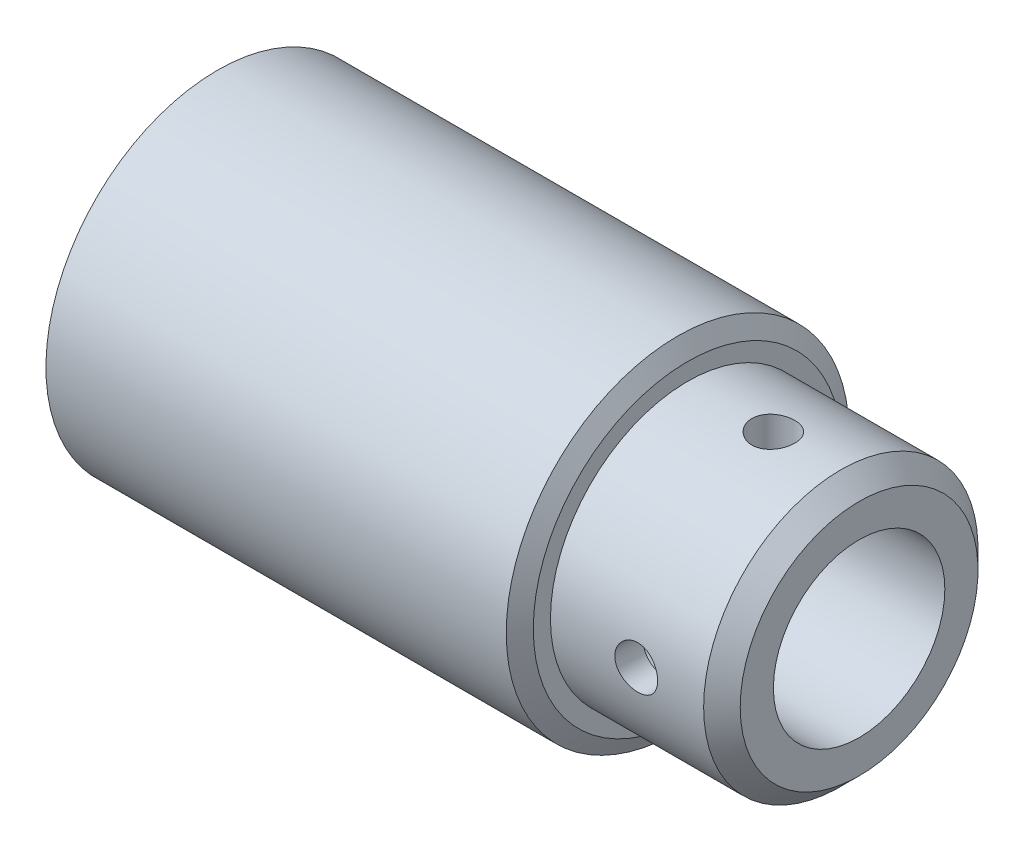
ISO-10303-21;
HEADER;
FILE_DESCRIPTION(('STEP AP214'),'2;1');
FILE_NAME('part.step','',(''),(''),'','','');
FILE_SCHEMA(('AUTOMOTIVE_DESIGN { 1 0 10303 214 1 1 1 1 }'));
ENDSEC;
DATA;
#1=APPLICATION_CONTEXT('core data for automotive mechanical design processes');
#2=APPLICATION_PROTOCOL_DEFINITION('international standard','automotive_design',2000,#1);
#3=PRODUCT_CONTEXT('',#1,'mechanical');
#4=PRODUCT('Part','Part','',(#3));
#5=PRODUCT_RELATED_PRODUCT_CATEGORY('part','',(#4));
#6=PRODUCT_DEFINITION_FORMATION('','',#4);
#7=PRODUCT_DEFINITION_CONTEXT('part definition',#1,'design');
#8=PRODUCT_DEFINITION('design','',#6,#7);
#9=PRODUCT_DEFINITION_SHAPE('','',#8);
#10=(LENGTH_UNIT() NAMED_UNIT(*) SI_UNIT(.MILLI.,.METRE.));
#11=(NAMED_UNIT(*) PLANE_ANGLE_UNIT() SI_UNIT($,.RADIAN.));
#12=(NAMED_UNIT(*) SI_UNIT($,.STERADIAN.) SOLID_ANGLE_UNIT());
#13=UNCERTAINTY_MEASURE_WITH_UNIT(LENGTH_MEASURE(1.E-05),#10,'distance_accuracy_value','');
#14=(GEOMETRIC_REPRESENTATION_CONTEXT(3) GLOBAL_UNCERTAINTY_ASSIGNED_CONTEXT((#13)) GLOBAL_UNIT_ASSIGNED_CONTEXT((#10,
#11,#12)) REPRESENTATION_CONTEXT('',''));
#15=CARTESIAN_POINT('',(0.,0.,0.));
#16=DIRECTION('',(0.,0.,1.));
#17=DIRECTION('',(1.,0.,0.));
#18=AXIS2_PLACEMENT_3D('',#15,#16,#17);
#19=CARTESIAN_POINT('',(16.5,0.,3.1766666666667));
#20=DIRECTION('',(0.,0.,1.));
#21=DIRECTION('',(1.,0.,0.));
#22=AXIS2_PLACEMENT_3D('',#19,#20,#21);
#23=CONICAL_SURFACE('',#22,0.625000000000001,1.1868238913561);
#24=CARTESIAN_POINT('',(16.5,0.,3.1766666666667));
#25=DIRECTION('',(0.,0.,-1.));
#26=DIRECTION('',(1.,0.,0.));
#27=AXIS2_PLACEMENT_3D('',#24,#25,#26);
#28=CIRCLE('',#27,0.625000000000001);
#29=CARTESIAN_POINT('',(17.125,0.,3.1766666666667));
#30=VERTEX_POINT('',#29);
#31=EDGE_CURVE('E115',#30,#30,#28,.T.);
#32=ORIENTED_EDGE('',*,*,#31,.F.);
#33=EDGE_LOOP('',(#32));
#34=FACE_BOUND('',#33,.T.);
#35=CARTESIAN_POINT('',(16.5,0.,2.9241502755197));
#36=VERTEX_POINT('',#35);
#37=VERTEX_LOOP('',#36);
#38=FACE_BOUND('',#37,.T.);
#39=ADVANCED_FACE('F16',(#34,#38),#23,.F.);
#40=CARTESIAN_POINT('',(19.,0.,0.));
#41=DIRECTION('',(-1.,0.,0.));
#42=DIRECTION('',(0.,0.,1.));
#43=AXIS2_PLACEMENT_3D('',#40,#41,#42);
#44=CONICAL_SURFACE('',#43,3.46666666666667,0.785398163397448);
#45=CARTESIAN_POINT('',(18.4666666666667,0.,0.));
#46=DIRECTION('',(-1.,0.,0.));
#47=DIRECTION('',(0.,1.,0.));
#48=AXIS2_PLACEMENT_3D('',#45,#46,#47);
#49=CIRCLE('',#48,4.);
#50=CARTESIAN_POINT('',(18.4666666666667,4.,0.));
#51=VERTEX_POINT('',#50);
#52=EDGE_CURVE('E100',#51,#51,#49,.T.);
#53=ORIENTED_EDGE('',*,*,#52,.F.);
#54=EDGE_LOOP('',(#53));
#55=FACE_BOUND('',#54,.T.);
#56=CARTESIAN_POINT('',(19.,0.,0.));
#57=DIRECTION('',(-1.,0.,0.));
#58=DIRECTION('',(0.,0.,1.));
#59=AXIS2_PLACEMENT_3D('',#56,#57,#58);
#60=CIRCLE('',#59,3.46666666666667);
#61=CARTESIAN_POINT('',(19.,0.,3.46666666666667));
#62=VERTEX_POINT('',#61);
#63=EDGE_CURVE('E19',#62,#62,#60,.F.);
#64=ORIENTED_EDGE('',*,*,#63,.F.);
#65=EDGE_LOOP('',(#64));
#66=FACE_BOUND('',#65,.T.);
#67=ADVANCED_FACE('F28',(#55,#66),#44,.T.);
#68=CARTESIAN_POINT('',(16.5,0.,4.00027866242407));
#69=DIRECTION('',(0.,0.,-1.));
#70=DIRECTION('',(-1.,0.,0.));
#71=AXIS2_PLACEMENT_3D('',#68,#69,#70);
#72=CYLINDRICAL_SURFACE('',#71,0.625000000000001);
#73=CARTESIAN_POINT('',(15.875,0.,4.));
#74=CARTESIAN_POINT('',(15.8750015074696,0.0348758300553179,3.99999939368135));
#75=CARTESIAN_POINT('',(15.8779292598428,0.0697735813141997,3.99953906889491));
#76=CARTESIAN_POINT('',(15.8895600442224,0.138594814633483,3.99774688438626));
#77=CARTESIAN_POINT('',(15.8982691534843,0.172517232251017,3.99641410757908));
#78=CARTESIAN_POINT('',(15.921195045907,0.238378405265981,3.9930267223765));
#79=CARTESIAN_POINT('',(15.9354073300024,0.270318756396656,3.99097270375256));
#80=CARTESIAN_POINT('',(15.9689250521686,0.331355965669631,3.98636943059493));
#81=CARTESIAN_POINT('',(15.988229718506,0.360453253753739,3.98382025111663));
#82=CARTESIAN_POINT('',(16.0315582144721,0.415229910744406,3.97848567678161));
#83=CARTESIAN_POINT('',(16.055616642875,0.44088175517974,3.97569864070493));
#84=CARTESIAN_POINT('',(16.1076953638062,0.487801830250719,3.97021520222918));
#85=CARTESIAN_POINT('',(16.1357159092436,0.509069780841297,3.96751880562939));
#86=CARTESIAN_POINT('',(16.1951095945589,0.546726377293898,3.96250606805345));
#87=CARTESIAN_POINT('',(16.2264999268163,0.563088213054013,3.96019184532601));
#88=CARTESIAN_POINT('',(16.2916254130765,0.590296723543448,3.95622800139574));
#89=CARTESIAN_POINT('',(16.3253604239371,0.601143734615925,3.95457833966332));
#90=CARTESIAN_POINT('',(16.3939276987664,0.616928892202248,3.95214658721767));
#91=CARTESIAN_POINT('',(16.4287488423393,0.621914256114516,3.95135756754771));
#92=CARTESIAN_POINT('',(16.498741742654,0.625980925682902,3.9507154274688));
#93=CARTESIAN_POINT('',(16.5339134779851,0.625062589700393,3.95086225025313));
#94=CARTESIAN_POINT('',(16.603274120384,0.617386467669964,3.95206887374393));
#95=CARTESIAN_POINT('',(16.6374690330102,0.610681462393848,3.95312042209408));
#96=CARTESIAN_POINT('',(16.7042427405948,0.591704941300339,3.95600512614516));
#97=CARTESIAN_POINT('',(16.7368214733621,0.579433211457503,3.95783831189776));
#98=CARTESIAN_POINT('',(16.7995984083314,0.549616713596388,3.96208885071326));
#99=CARTESIAN_POINT('',(16.8297858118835,0.532049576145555,3.96450867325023));
#100=CARTESIAN_POINT('',(16.8868019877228,0.49215837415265,3.96965782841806));
#101=CARTESIAN_POINT('',(16.9136307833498,0.469834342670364,3.97238715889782));
#102=CARTESIAN_POINT('',(16.9634719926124,0.420778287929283,3.97788385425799));
#103=CARTESIAN_POINT('',(16.9864405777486,0.394001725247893,3.98065131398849));
#104=CARTESIAN_POINT('',(17.0275751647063,0.336937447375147,3.98588669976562));
#105=CARTESIAN_POINT('',(17.0457390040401,0.30664815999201,3.98835449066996));
#106=CARTESIAN_POINT('',(17.0767504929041,0.243367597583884,3.99271578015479));
#107=CARTESIAN_POINT('',(17.0895902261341,0.210372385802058,3.99460842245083));
#108=CARTESIAN_POINT('',(17.1095058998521,0.142711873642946,3.99759599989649));
#109=CARTESIAN_POINT('',(17.1165940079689,0.108050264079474,3.99869261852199));
#110=CARTESIAN_POINT('',(17.1235705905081,0.0488153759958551,3.99977625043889));
#111=CARTESIAN_POINT('',(17.1250018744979,0.0244140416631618,4.00000064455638));
#112=CARTESIAN_POINT('',(17.1249973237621,-0.0348561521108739,3.99999907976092));
#113=CARTESIAN_POINT('',(17.1220733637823,-0.0697382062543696,3.99953945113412));
#114=CARTESIAN_POINT('',(17.1104489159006,-0.138561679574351,3.99774828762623));
#115=CARTESIAN_POINT('',(17.1017366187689,-0.172501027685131,3.99641497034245));
#116=CARTESIAN_POINT('',(17.0788033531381,-0.238382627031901,3.9930264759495));
#117=CARTESIAN_POINT('',(17.0645888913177,-0.270327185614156,3.99097215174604));
#118=CARTESIAN_POINT('',(17.0310698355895,-0.331363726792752,3.98636876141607));
#119=CARTESIAN_POINT('',(17.0117673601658,-0.360456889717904,3.98381990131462));
#120=CARTESIAN_POINT('',(16.9684446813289,-0.415226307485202,3.97848602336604));
#121=CARTESIAN_POINT('',(16.9443898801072,-0.440875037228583,3.97569936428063));
#122=CARTESIAN_POINT('',(16.8923116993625,-0.487796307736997,3.97021590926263));
#123=CARTESIAN_POINT('',(16.8642870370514,-0.509067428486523,3.96751914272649));
#124=CARTESIAN_POINT('',(16.8048753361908,-0.546736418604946,3.96250470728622));
#125=CARTESIAN_POINT('',(16.7734698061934,-0.563105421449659,3.96018931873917));
#126=CARTESIAN_POINT('',(16.708334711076,-0.590308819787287,3.95622625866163));
#127=CARTESIAN_POINT('',(16.6746078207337,-0.601149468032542,3.95457783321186));
#128=CARTESIAN_POINT('',(16.6172497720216,-0.61435673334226,3.95254258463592));
#129=CARTESIAN_POINT('',(16.5939868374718,-0.6183420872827,3.95191857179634));
#130=CARTESIAN_POINT('',(16.5471526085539,-0.623664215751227,3.95108214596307));
#131=CARTESIAN_POINT('',(16.5235813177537,-0.625001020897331,3.95086972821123));
#132=CARTESIAN_POINT('',(16.4651271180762,-0.624998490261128,3.95087079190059));
#133=CARTESIAN_POINT('',(16.4302323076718,-0.622071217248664,3.95133691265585));
#134=CARTESIAN_POINT('',(16.3614171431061,-0.610442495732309,3.95314978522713));
#135=CARTESIAN_POINT('',(16.3274978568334,-0.60173495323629,3.95449746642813));
#136=CARTESIAN_POINT('',(16.2616428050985,-0.57881348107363,3.95791717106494));
#137=CARTESIAN_POINT('',(16.2297054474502,-0.564604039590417,3.95998860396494));
#138=CARTESIAN_POINT('',(16.1686741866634,-0.53109342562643,3.96462161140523));
#139=CARTESIAN_POINT('',(16.139579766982,-0.511793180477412,3.96718309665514));
#140=CARTESIAN_POINT('',(16.0848038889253,-0.468471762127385,3.97253230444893));
#141=CARTESIAN_POINT('',(16.0591503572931,-0.444415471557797,3.97532161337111));
#142=CARTESIAN_POINT('',(16.0122210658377,-0.392333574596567,3.980798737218));
#143=CARTESIAN_POINT('',(15.9909465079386,-0.364306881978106,3.98348652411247));
#144=CARTESIAN_POINT('',(15.9532737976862,-0.304893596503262,3.98847501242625));
#145=CARTESIAN_POINT('',(15.9369038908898,-0.273488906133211,3.9907734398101));
#146=CARTESIAN_POINT('',(15.9096984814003,-0.208355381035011,3.99470250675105));
#147=CARTESIAN_POINT('',(15.8988567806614,-0.174629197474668,3.99633389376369));
#148=CARTESIAN_POINT('',(15.885646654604,-0.117268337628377,3.99834706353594));
#149=CARTESIAN_POINT('',(15.8816600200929,-0.094001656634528,3.99896390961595));
#150=CARTESIAN_POINT('',(15.8763361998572,-0.0471599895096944,3.99979058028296));
#151=CARTESIAN_POINT('',(15.8749989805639,-0.0235850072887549,4.00000041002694));
#152=CARTESIAN_POINT('',(15.875,0.,4.));
#153=B_SPLINE_CURVE_WITH_KNOTS('',3,(#73,#74,#75,#76,#77,#78,#79,#80,#81,#82,#83,#84,#85,#86,
#87,#88,#89,#90,#91,#92,#93,#94,#95,#96,#97,#98,#99,#100,#101,#102,#103,#104,#105,#106,#107,
#108,#109,#110,#111,#112,#113,#114,#115,#116,#117,#118,#119,#120,#121,#122,#123,#124,#125,#126,
#127,#128,#129,#130,#131,#132,#133,#134,#135,#136,#137,#138,#139,#140,#141,#142,#143,#144,#145,
#146,#147,#148,#149,#150,#151,#152),.UNSPECIFIED.,.T.,.F.,(4,2,2,2,2,2,2,2,2,2,2,2,2,2,2,2,2,2,
2,2,2,2,2,2,2,2,2,2,2,2,2,2,2,2,2,2,2,2,2,4),(0.,0.104541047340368,0.209192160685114,
0.31375789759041,0.418307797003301,0.523648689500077,0.628996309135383,0.734909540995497,
0.840816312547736,0.945863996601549,1.05090530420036,1.15499852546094,1.25909574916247,
1.36363902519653,1.46818157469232,1.57384086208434,1.67954762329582,1.78541099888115,
1.89104983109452,1.96423641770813,2.06872558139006,2.17342857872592,2.27800813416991,
2.38254421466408,2.48787141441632,2.59323272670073,2.69920279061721,2.80505273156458,
2.87573903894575,2.94642452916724,3.05095671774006,3.15559928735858,3.26015667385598,
3.36469502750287,3.47003621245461,3.57540627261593,3.6813719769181,3.78721861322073,
3.85791607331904,3.92861263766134),.UNSPECIFIED.);
#154=CARTESIAN_POINT('',(15.875,0.,4.));
#155=VERTEX_POINT('',#154);
#156=EDGE_CURVE('E101',#155,#155,#153,.T.);
#157=ORIENTED_EDGE('',*,*,#156,.F.);
#158=EDGE_LOOP('',(#157));
#159=FACE_BOUND('',#158,.T.);
#160=ORIENTED_EDGE('',*,*,#31,.T.);
#161=EDGE_LOOP('',(#160));
#162=FACE_BOUND('',#161,.T.);
#163=ADVANCED_FACE('F34',(#159,#162),#72,.F.);
#164=CARTESIAN_POINT('',(19.,3.46666666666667,3.50826877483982));
#165=DIRECTION('',(1.,0.,0.));
#166=DIRECTION('',(0.,-1.,0.));
#167=AXIS2_PLACEMENT_3D('',#164,#165,#166);
#168=PLANE('',#167);
#169=CARTESIAN_POINT('',(19.,0.,0.));
#170=DIRECTION('',(-1.,0.,0.));
#171=DIRECTION('',(0.,0.,1.));
#172=AXIS2_PLACEMENT_3D('',#169,#170,#171);
#173=CIRCLE('',#172,2.5);
#174=CARTESIAN_POINT('',(19.,0.,2.5));
#175=VERTEX_POINT('',#174);
#176=EDGE_CURVE('E85',#175,#175,#173,.F.);
#177=ORIENTED_EDGE('',*,*,#176,.F.);
#178=EDGE_LOOP('',(#177));
#179=FACE_BOUND('',#178,.T.);
#180=ORIENTED_EDGE('',*,*,#63,.T.);
#181=EDGE_LOOP('',(#180));
#182=FACE_BOUND('',#181,.T.);
#183=ADVANCED_FACE('F92',(#179,#182),#168,.T.);
#184=CARTESIAN_POINT('',(16.5,2.42032556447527,0.));
#185=DIRECTION('',(0.,1.,0.));
#186=DIRECTION('',(0.,0.,1.));
#187=AXIS2_PLACEMENT_3D('',#184,#185,#186);
#188=CYLINDRICAL_SURFACE('',#187,0.625000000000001);
#189=CARTESIAN_POINT('',(16.5,2.42061459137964,-0.625000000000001));
#190=CARTESIAN_POINT('',(16.4654994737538,2.42061559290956,-0.624998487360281));
#191=CARTESIAN_POINT('',(16.4309791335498,2.4213605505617,-0.622132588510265));
#192=CARTESIAN_POINT('',(16.3629202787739,2.42425369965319,-0.61075935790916));
#193=CARTESIAN_POINT('',(16.3293827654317,2.42640327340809,-0.602246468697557));
#194=CARTESIAN_POINT('',(16.2642976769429,2.43184698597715,-0.579872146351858));
#195=CARTESIAN_POINT('',(16.2327473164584,2.43513947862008,-0.566018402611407));
#196=CARTESIAN_POINT('',(16.1724189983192,2.44249592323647,-0.53337819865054));
#197=CARTESIAN_POINT('',(16.1436408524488,2.44655982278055,-0.514592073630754));
#198=CARTESIAN_POINT('',(16.0890374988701,2.45510134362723,-0.472179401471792));
#199=CARTESIAN_POINT('',(16.0632820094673,2.45958556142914,-0.448464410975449));
#200=CARTESIAN_POINT('',(16.0160641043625,2.46840627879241,-0.397051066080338));
#201=CARTESIAN_POINT('',(15.9946029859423,2.47274273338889,-0.369351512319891));
#202=CARTESIAN_POINT('',(15.9562965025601,2.48085311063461,-0.310272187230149));
#203=CARTESIAN_POINT('',(15.9395218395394,2.48461806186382,-0.278845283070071));
#204=CARTESIAN_POINT('',(15.9115358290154,2.49107972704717,-0.213528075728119));
#205=CARTESIAN_POINT('',(15.9003180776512,2.49377766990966,-0.179640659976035));
#206=CARTESIAN_POINT('',(15.8864023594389,2.49716808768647,-0.121319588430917));
#207=CARTESIAN_POINT('',(15.8821337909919,2.4982245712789,-0.0972700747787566));
#208=CARTESIAN_POINT('',(15.8764321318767,2.4996408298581,-0.0488169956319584));
#209=CARTESIAN_POINT('',(15.8749989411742,2.50000062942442,-0.0244134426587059));
#210=CARTESIAN_POINT('',(15.8750014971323,2.49999911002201,0.0345195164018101));
#211=CARTESIAN_POINT('',(15.8778704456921,2.49927762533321,0.0690588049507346));
#212=CARTESIAN_POINT('',(15.8892568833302,2.49646806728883,0.137157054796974));
#213=CARTESIAN_POINT('',(15.8977798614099,2.49437866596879,0.170715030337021));
#214=CARTESIAN_POINT('',(15.9201835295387,2.48906497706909,0.235843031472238));
#215=CARTESIAN_POINT('',(15.9340569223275,2.48584223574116,0.267415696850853));
#216=CARTESIAN_POINT('',(15.9667438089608,2.4786052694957,0.327782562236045));
#217=CARTESIAN_POINT('',(15.9855570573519,2.47459108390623,0.35657690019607));
#218=CARTESIAN_POINT('',(16.0280001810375,2.46611425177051,0.411167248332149));
#219=CARTESIAN_POINT('',(16.0517128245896,2.46164467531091,0.436897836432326));
#220=CARTESIAN_POINT('',(16.1031046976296,2.45280681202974,0.484061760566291));
#221=CARTESIAN_POINT('',(16.1307844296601,2.44843853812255,0.505494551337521));
#222=CARTESIAN_POINT('',(16.1898313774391,2.4402282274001,0.543761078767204));
#223=CARTESIAN_POINT('',(16.2212472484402,2.43639496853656,0.560521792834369));
#224=CARTESIAN_POINT('',(16.286561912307,2.42978955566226,0.588498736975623));
#225=CARTESIAN_POINT('',(16.3204603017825,2.42701722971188,0.59971586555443));
#226=CARTESIAN_POINT('',(16.3890597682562,2.42291865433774,0.616064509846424));
#227=CARTESIAN_POINT('',(16.4237311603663,2.42156454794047,0.621313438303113));
#228=CARTESIAN_POINT('',(16.4934868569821,2.42037234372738,0.625942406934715));
#229=CARTESIAN_POINT('',(16.5285710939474,2.42053400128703,0.625323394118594));
#230=CARTESIAN_POINT('',(16.5972564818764,2.42233002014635,0.618327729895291));
#231=CARTESIAN_POINT('',(16.630872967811,2.42392858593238,0.612091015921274));
#232=CARTESIAN_POINT('',(16.6965669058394,2.42836127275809,0.594260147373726));
#233=CARTESIAN_POINT('',(16.7286442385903,2.4311954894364,0.582665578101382));
#234=CARTESIAN_POINT('',(16.7907252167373,2.4378130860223,0.554328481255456));
#235=CARTESIAN_POINT('',(16.8207045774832,2.44160578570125,0.537535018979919));
#236=CARTESIAN_POINT('',(16.8774679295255,2.44970741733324,0.499313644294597));
#237=CARTESIAN_POINT('',(16.9042515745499,2.45401640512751,0.477885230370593));
#238=CARTESIAN_POINT('',(16.9546630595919,2.4628152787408,0.430281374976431));
#239=CARTESIAN_POINT('',(16.97817993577,2.46730683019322,0.403988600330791));
#240=CARTESIAN_POINT('',(17.0205013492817,2.47585656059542,0.347766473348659));
#241=CARTESIAN_POINT('',(17.039303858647,2.47991455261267,0.317835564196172));
#242=CARTESIAN_POINT('',(17.0717030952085,2.48716068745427,0.255020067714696));
#243=CARTESIAN_POINT('',(17.085277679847,2.49034511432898,0.222123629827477));
#244=CARTESIAN_POINT('',(17.1066476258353,2.49545331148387,0.154458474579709));
#245=CARTESIAN_POINT('',(17.1144550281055,2.4973797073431,0.119693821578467));
#246=CARTESIAN_POINT('',(17.1211685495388,2.49904443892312,0.070535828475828));
#247=CARTESIAN_POINT('',(17.122603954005,2.49940189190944,0.0564714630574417));
#248=CARTESIAN_POINT('',(17.1245200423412,2.49987988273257,0.0282736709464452));
#249=CARTESIAN_POINT('',(17.1250007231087,2.50000041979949,0.0141402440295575));
#250=CARTESIAN_POINT('',(17.1249982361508,2.49999897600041,-0.0344917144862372));
#251=CARTESIAN_POINT('',(17.1221321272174,2.49927826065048,-0.0690239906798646));
#252=CARTESIAN_POINT('',(17.1107509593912,2.49647000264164,-0.137129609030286));
#253=CARTESIAN_POINT('',(17.1022252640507,2.49437988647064,-0.170701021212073));
#254=CARTESIAN_POINT('',(17.0798151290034,2.48906465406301,-0.23584604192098));
#255=CARTESIAN_POINT('',(17.0659398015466,2.48584146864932,-0.267422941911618));
#256=CARTESIAN_POINT('',(17.0332517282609,2.47860432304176,-0.327789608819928));
#257=CARTESIAN_POINT('',(17.0144403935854,2.47459058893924,-0.356580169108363));
#258=CARTESIAN_POINT('',(16.9720024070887,2.46611475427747,-0.411163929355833));
#259=CARTESIAN_POINT('',(16.9482930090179,2.46164572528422,-0.436891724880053));
#260=CARTESIAN_POINT('',(16.896901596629,2.45280784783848,-0.484056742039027));
#261=CARTESIAN_POINT('',(16.869218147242,2.44843903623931,-0.505492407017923));
#262=CARTESIAN_POINT('',(16.8101543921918,2.44022610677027,-0.543770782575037));
#263=CARTESIAN_POINT('',(16.7787241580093,2.43639100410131,-0.560538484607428));
#264=CARTESIAN_POINT('',(16.7134000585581,2.4297867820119,-0.588510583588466));
#265=CARTESIAN_POINT('',(16.6795091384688,2.42701641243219,-0.599721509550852));
#266=CARTESIAN_POINT('',(16.6212059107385,2.42353130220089,-0.613619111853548));
#267=CARTESIAN_POINT('',(16.5971792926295,2.42244370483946,-0.617879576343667));
#268=CARTESIAN_POINT('',(16.5487717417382,2.42098500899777,-0.623570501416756));
#269=CARTESIAN_POINT('',(16.5243908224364,2.42061388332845,-0.625001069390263));
#270=CARTESIAN_POINT('',(16.5,2.42061459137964,-0.625000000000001));
#271=B_SPLINE_CURVE_WITH_KNOTS('',3,(#189,#190,#191,#192,#193,#194,#195,#196,#197,#198,#199,
#200,#201,#202,#203,#204,#205,#206,#207,#208,#209,#210,#211,#212,#213,#214,#215,#216,#217,#218,
#219,#220,#221,#222,#223,#224,#225,#226,#227,#228,#229,#230,#231,#232,#233,#234,#235,#236,#237,
#238,#239,#240,#241,#242,#243,#244,#245,#246,#247,#248,#249,#250,#251,#252,#253,#254,#255,#256,
#257,#258,#259,#260,#261,#262,#263,#264,#265,#266,#267,#268,#269,#270),.UNSPECIFIED.,.T.,.F.,(4,
2,2,2,2,2,2,2,2,2,2,2,2,2,2,2,2,2,2,2,2,2,2,2,2,2,2,2,2,2,2,2,2,2,2,2,2,2,2,2,4),(0.,
0.103411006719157,0.206923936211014,0.310288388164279,0.413645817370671,0.519048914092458,
0.624483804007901,0.731432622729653,0.838257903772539,0.911436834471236,0.984613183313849,
1.08808126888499,1.19164994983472,1.2950778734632,1.39850065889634,1.5038392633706,
1.60919122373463,1.71610766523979,1.82300677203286,1.92776434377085,2.03250500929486,
2.13470660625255,2.23691611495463,2.34016050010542,2.4434160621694,2.54959826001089,
2.65582605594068,2.76249895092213,2.86894849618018,2.91134686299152,2.95374536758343,
3.05716629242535,3.16078213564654,3.26422225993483,3.36763284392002,3.47295906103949,
3.57832340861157,3.68529417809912,3.79213896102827,3.86525017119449,3.93835860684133),.UNSPECIFIED.);
#272=CARTESIAN_POINT('',(16.5,2.42061459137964,-0.625000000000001));
#273=VERTEX_POINT('',#272);
#274=EDGE_CURVE('E78',#273,#273,#271,.T.);
#275=ORIENTED_EDGE('',*,*,#274,.F.);
#276=EDGE_LOOP('',(#275));
#277=FACE_BOUND('',#276,.T.);
#278=CARTESIAN_POINT('',(17.125,4.,0.));
#279=CARTESIAN_POINT('',(17.1249984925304,3.99999939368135,0.034875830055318));
#280=CARTESIAN_POINT('',(17.1220707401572,3.99953906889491,0.0697735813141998));
#281=CARTESIAN_POINT('',(17.1104399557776,3.99774688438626,0.138594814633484));
#282=CARTESIAN_POINT('',(17.1017308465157,3.99641410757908,0.172517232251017));
#283=CARTESIAN_POINT('',(17.078804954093,3.9930267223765,0.238378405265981));
#284=CARTESIAN_POINT('',(17.0645926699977,3.99097270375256,0.270318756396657));
#285=CARTESIAN_POINT('',(17.0310749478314,3.98636943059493,0.331355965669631));
#286=CARTESIAN_POINT('',(17.011770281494,3.98382025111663,0.360453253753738));
#287=CARTESIAN_POINT('',(16.9684417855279,3.97848567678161,0.415229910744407));
#288=CARTESIAN_POINT('',(16.944383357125,3.97569864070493,0.440881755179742));
#289=CARTESIAN_POINT('',(16.8923046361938,3.97021520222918,0.487801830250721));
#290=CARTESIAN_POINT('',(16.8642840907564,3.96751880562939,0.509069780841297));
#291=CARTESIAN_POINT('',(16.8048904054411,3.96250606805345,0.5467263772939));
#292=CARTESIAN_POINT('',(16.7735000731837,3.96019184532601,0.563088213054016));
#293=CARTESIAN_POINT('',(16.7083745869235,3.95622800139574,0.59029672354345));
#294=CARTESIAN_POINT('',(16.6746395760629,3.95457833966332,0.601143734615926));
#295=CARTESIAN_POINT('',(16.6060723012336,3.95214658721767,0.616928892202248));
#296=CARTESIAN_POINT('',(16.5712511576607,3.95135756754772,0.621914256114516));
#297=CARTESIAN_POINT('',(16.501258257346,3.9507154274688,0.625980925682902));
#298=CARTESIAN_POINT('',(16.4660865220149,3.95086225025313,0.625062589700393));
#299=CARTESIAN_POINT('',(16.396725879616,3.95206887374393,0.617386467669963));
#300=CARTESIAN_POINT('',(16.3625309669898,3.95312042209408,0.610681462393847));
#301=CARTESIAN_POINT('',(16.2957572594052,3.95600512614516,0.591704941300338));
#302=CARTESIAN_POINT('',(16.2631785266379,3.95783831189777,0.579433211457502));
#303=CARTESIAN_POINT('',(16.2004015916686,3.96208885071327,0.549616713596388));
#304=CARTESIAN_POINT('',(16.1702141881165,3.96450867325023,0.532049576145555));
#305=CARTESIAN_POINT('',(16.1131980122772,3.96965782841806,0.49215837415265));
#306=CARTESIAN_POINT('',(16.0863692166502,3.97238715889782,0.469834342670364));
#307=CARTESIAN_POINT('',(16.0365280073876,3.97788385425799,0.420778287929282));
#308=CARTESIAN_POINT('',(16.0135594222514,3.98065131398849,0.394001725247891));
#309=CARTESIAN_POINT('',(15.9724248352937,3.98588669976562,0.336937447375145));
#310=CARTESIAN_POINT('',(15.9542609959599,3.98835449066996,0.306648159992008));
#311=CARTESIAN_POINT('',(15.9232495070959,3.99271578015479,0.243367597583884));
#312=CARTESIAN_POINT('',(15.9104097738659,3.99460842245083,0.210372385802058));
#313=CARTESIAN_POINT('',(15.8904941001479,3.99759599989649,0.142711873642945));
#314=CARTESIAN_POINT('',(15.8834059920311,3.99869261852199,0.108050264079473));
#315=CARTESIAN_POINT('',(15.8764294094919,3.99977625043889,0.0488153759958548));
#316=CARTESIAN_POINT('',(15.8749981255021,4.00000064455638,0.0244140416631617));
#317=CARTESIAN_POINT('',(15.8750026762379,3.99999907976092,-0.0348561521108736));
#318=CARTESIAN_POINT('',(15.8779266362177,3.99953945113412,-0.0697382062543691));
#319=CARTESIAN_POINT('',(15.8895510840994,3.99774828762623,-0.138561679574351));
#320=CARTESIAN_POINT('',(15.8982633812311,3.99641497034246,-0.17250102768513));
#321=CARTESIAN_POINT('',(15.9211966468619,3.9930264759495,-0.238382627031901));
#322=CARTESIAN_POINT('',(15.9354111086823,3.99097215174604,-0.270327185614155));
#323=CARTESIAN_POINT('',(15.9689301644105,3.98636876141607,-0.331363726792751));
#324=CARTESIAN_POINT('',(15.9882326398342,3.98381990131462,-0.360456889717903));
#325=CARTESIAN_POINT('',(16.0315553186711,3.97848602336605,-0.415226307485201));
#326=CARTESIAN_POINT('',(16.0556101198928,3.97569936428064,-0.440875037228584));
#327=CARTESIAN_POINT('',(16.1076883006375,3.97021590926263,-0.487796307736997));
#328=CARTESIAN_POINT('',(16.1357129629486,3.96751914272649,-0.509067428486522));
#329=CARTESIAN_POINT('',(16.1951246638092,3.96250470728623,-0.546736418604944));
#330=CARTESIAN_POINT('',(16.2265301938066,3.96018931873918,-0.563105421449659));
#331=CARTESIAN_POINT('',(16.291665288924,3.95622625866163,-0.590308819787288));
#332=CARTESIAN_POINT('',(16.3253921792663,3.95457783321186,-0.601149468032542));
#333=CARTESIAN_POINT('',(16.3827502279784,3.95254258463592,-0.61435673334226));
#334=CARTESIAN_POINT('',(16.4060131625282,3.95191857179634,-0.6183420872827));
#335=CARTESIAN_POINT('',(16.4528473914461,3.95108214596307,-0.623664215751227));
#336=CARTESIAN_POINT('',(16.4764186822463,3.95086972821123,-0.625001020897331));
#337=CARTESIAN_POINT('',(16.5348728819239,3.95087079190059,-0.624998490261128));
#338=CARTESIAN_POINT('',(16.5697676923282,3.95133691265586,-0.622071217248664));
#339=CARTESIAN_POINT('',(16.6385828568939,3.95314978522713,-0.610442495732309));
#340=CARTESIAN_POINT('',(16.6725021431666,3.95449746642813,-0.60173495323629));
#341=CARTESIAN_POINT('',(16.7383571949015,3.95791717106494,-0.57881348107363));
#342=CARTESIAN_POINT('',(16.7702945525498,3.95998860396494,-0.564604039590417));
#343=CARTESIAN_POINT('',(16.8313258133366,3.96462161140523,-0.53109342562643));
#344=CARTESIAN_POINT('',(16.860420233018,3.96718309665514,-0.511793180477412));
#345=CARTESIAN_POINT('',(16.9151961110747,3.97253230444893,-0.468471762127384));
#346=CARTESIAN_POINT('',(16.9408496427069,3.97532161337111,-0.444415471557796));
#347=CARTESIAN_POINT('',(16.9877789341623,3.980798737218,-0.392333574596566));
#348=CARTESIAN_POINT('',(17.0090534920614,3.98348652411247,-0.364306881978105));
#349=CARTESIAN_POINT('',(17.0467262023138,3.98847501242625,-0.304893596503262));
#350=CARTESIAN_POINT('',(17.0630961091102,3.9907734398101,-0.273488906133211));
#351=CARTESIAN_POINT('',(17.0903015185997,3.99470250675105,-0.208355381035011));
#352=CARTESIAN_POINT('',(17.1011432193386,3.99633389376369,-0.174629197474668));
#353=CARTESIAN_POINT('',(17.114353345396,3.99834706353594,-0.117268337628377));
#354=CARTESIAN_POINT('',(17.1183399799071,3.99896390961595,-0.094001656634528));
#355=CARTESIAN_POINT('',(17.1236638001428,3.99979058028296,-0.0471599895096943));
#356=CARTESIAN_POINT('',(17.1250010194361,4.00000041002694,-0.0235850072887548));
#357=CARTESIAN_POINT('',(17.125,4.,0.));
#358=B_SPLINE_CURVE_WITH_KNOTS('',3,(#278,#279,#280,#281,#282,#283,#284,#285,#286,#287,#288,
#289,#290,#291,#292,#293,#294,#295,#296,#297,#298,#299,#300,#301,#302,#303,#304,#305,#306,#307,
#308,#309,#310,#311,#312,#313,#314,#315,#316,#317,#318,#319,#320,#321,#322,#323,#324,#325,#326,
#327,#328,#329,#330,#331,#332,#333,#334,#335,#336,#337,#338,#339,#340,#341,#342,#343,#344,#345,
#346,#347,#348,#349,#350,#351,#352,#353,#354,#355,#356,#357),.UNSPECIFIED.,.T.,.F.,(4,2,2,2,2,2,
2,2,2,2,2,2,2,2,2,2,2,2,2,2,2,2,2,2,2,2,2,2,2,2,2,2,2,2,2,2,2,2,2,4),(0.,0.104541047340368,
0.209192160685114,0.31375789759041,0.418307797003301,0.523648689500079,0.628996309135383,
0.734909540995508,0.840816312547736,0.945863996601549,1.05090530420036,1.15499852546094,
1.25909574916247,1.36363902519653,1.46818157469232,1.57384086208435,1.67954762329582,
1.78541099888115,1.89104983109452,1.96423641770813,2.06872558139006,2.17342857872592,
2.27800813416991,2.38254421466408,2.48787141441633,2.59323272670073,2.69920279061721,
2.80505273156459,2.87573903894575,2.94642452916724,3.05095671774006,3.15559928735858,
3.26015667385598,3.36469502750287,3.47003621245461,3.57540627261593,3.68137197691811,
3.78721861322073,3.85791607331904,3.92861263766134),.UNSPECIFIED.);
#359=CARTESIAN_POINT('',(17.125,4.,0.));
#360=VERTEX_POINT('',#359);
#361=EDGE_CURVE('E96',#360,#360,#358,.T.);
#362=ORIENTED_EDGE('',*,*,#361,.F.);
#363=EDGE_LOOP('',(#362));
#364=FACE_BOUND('',#363,.T.);
#365=ADVANCED_FACE('F88',(#277,#364),#188,.F.);
#366=CARTESIAN_POINT('',(14.,0.,0.));
#367=DIRECTION('',(-1.,0.,0.));
#368=DIRECTION('',(0.,0.,1.));
#369=AXIS2_PLACEMENT_3D('',#366,#367,#368);
#370=CYLINDRICAL_SURFACE('',#369,4.);
#371=ORIENTED_EDGE('',*,*,#361,.T.);
#372=EDGE_LOOP('',(#371));
#373=FACE_BOUND('',#372,.T.);
#374=CARTESIAN_POINT('',(14.,0.,0.));
#375=DIRECTION('',(-1.,0.,0.));
#376=DIRECTION('',(0.,0.,1.));
#377=AXIS2_PLACEMENT_3D('',#374,#375,#376);
#378=CIRCLE('',#377,4.);
#379=CARTESIAN_POINT('',(14.,0.,4.));
#380=VERTEX_POINT('',#379);
#381=EDGE_CURVE('E84',#380,#380,#378,.T.);
#382=ORIENTED_EDGE('',*,*,#381,.F.);
#383=EDGE_LOOP('',(#382));
#384=FACE_BOUND('',#383,.T.);
#385=ORIENTED_EDGE('',*,*,#156,.T.);
#386=EDGE_LOOP('',(#385));
#387=FACE_BOUND('',#386,.T.);
#388=ORIENTED_EDGE('',*,*,#52,.T.);
#389=EDGE_LOOP('',(#388));
#390=FACE_BOUND('',#389,.T.);
#391=ADVANCED_FACE('F73',(#373,#384,#387,#390),#370,.T.);
#392=CARTESIAN_POINT('',(19.,0.,0.));
#393=DIRECTION('',(-1.,0.,0.));
#394=DIRECTION('',(0.,0.,1.));
#395=AXIS2_PLACEMENT_3D('',#392,#393,#394);
#396=CYLINDRICAL_SURFACE('',#395,2.5);
#397=ORIENTED_EDGE('',*,*,#176,.T.);
#398=EDGE_LOOP('',(#397));
#399=FACE_BOUND('',#398,.T.);
#400=CARTESIAN_POINT('',(4.66666666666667,0.,0.));
#401=DIRECTION('',(-1.,0.,0.));
#402=DIRECTION('',(0.,0.,1.));
#403=AXIS2_PLACEMENT_3D('',#400,#401,#402);
#404=CIRCLE('',#403,2.5);
#405=CARTESIAN_POINT('',(4.66666666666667,0.,2.5));
#406=VERTEX_POINT('',#405);
#407=EDGE_CURVE('E130',#406,#406,#404,.F.);
#408=ORIENTED_EDGE('',*,*,#407,.F.);
#409=EDGE_LOOP('',(#408));
#410=FACE_BOUND('',#409,.T.);
#411=ORIENTED_EDGE('',*,*,#274,.T.);
#412=EDGE_LOOP('',(#411));
#413=FACE_BOUND('',#412,.T.);
#414=ADVANCED_FACE('F68',(#399,#410,#413),#396,.F.);
#415=CARTESIAN_POINT('',(14.,4.5,4.55400210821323));
#416=DIRECTION('',(1.,0.,0.));
#417=DIRECTION('',(0.,-1.,0.));
#418=AXIS2_PLACEMENT_3D('',#415,#416,#417);
#419=PLANE('',#418);
#420=ORIENTED_EDGE('',*,*,#381,.T.);
#421=EDGE_LOOP('',(#420));
#422=FACE_BOUND('',#421,.T.);
#423=CARTESIAN_POINT('',(14.,0.,0.));
#424=DIRECTION('',(-1.,0.,0.));
#425=DIRECTION('',(0.,0.,1.));
#426=AXIS2_PLACEMENT_3D('',#423,#424,#425);
#427=CIRCLE('',#426,4.5);
#428=CARTESIAN_POINT('',(14.,0.,4.5));
#429=VERTEX_POINT('',#428);
#430=EDGE_CURVE('E128',#429,#429,#427,.T.);
#431=ORIENTED_EDGE('',*,*,#430,.F.);
#432=EDGE_LOOP('',(#431));
#433=FACE_BOUND('',#432,.T.);
#434=ADVANCED_FACE('F64',(#422,#433),#419,.T.);
#435=CARTESIAN_POINT('',(4.66666666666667,-3.57142857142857,3.6142878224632));
#436=DIRECTION('',(-1.,0.,0.));
#437=DIRECTION('',(0.,1.,0.));
#438=AXIS2_PLACEMENT_3D('',#435,#436,#437);
#439=PLANE('',#438);
#440=ORIENTED_EDGE('',*,*,#407,.T.);
#441=EDGE_LOOP('',(#440));
#442=FACE_BOUND('',#441,.T.);
#443=CARTESIAN_POINT('',(4.66666666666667,0.,0.));
#444=DIRECTION('',(-1.,0.,0.));
#445=DIRECTION('',(0.,0.,1.));
#446=AXIS2_PLACEMENT_3D('',#443,#444,#445);
#447=CIRCLE('',#446,3.57142857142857);
#448=CARTESIAN_POINT('',(4.66666666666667,0.,3.57142857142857));
#449=VERTEX_POINT('',#448);
#450=EDGE_CURVE('E125',#449,#449,#447,.F.);
#451=ORIENTED_EDGE('',*,*,#450,.F.);
#452=EDGE_LOOP('',(#451));
#453=FACE_BOUND('',#452,.T.);
#454=ADVANCED_FACE('F60',(#442,#453),#439,.T.);
#455=CARTESIAN_POINT('',(14.,0.,0.));
#456=DIRECTION('',(-1.,0.,0.));
#457=DIRECTION('',(0.,0.,1.));
#458=AXIS2_PLACEMENT_3D('',#455,#456,#457);
#459=CONICAL_SURFACE('',#458,4.5,1.0471975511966);
#460=ORIENTED_EDGE('',*,*,#430,.T.);
#461=EDGE_LOOP('',(#460));
#462=FACE_BOUND('',#461,.T.);
#463=CARTESIAN_POINT('',(13.7113248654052,0.,0.));
#464=DIRECTION('',(-1.,0.,0.));
#465=DIRECTION('',(0.,1.,0.));
#466=AXIS2_PLACEMENT_3D('',#463,#464,#465);
#467=CIRCLE('',#466,5.);
#468=CARTESIAN_POINT('',(13.7113248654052,5.,0.));
#469=VERTEX_POINT('',#468);
#470=EDGE_CURVE('E124',#469,#469,#467,.T.);
#471=ORIENTED_EDGE('',*,*,#470,.F.);
#472=EDGE_LOOP('',(#471));
#473=FACE_BOUND('',#472,.T.);
#474=ADVANCED_FACE('F56',(#462,#473),#459,.T.);
#475=CARTESIAN_POINT('',(4.66666666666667,0.,0.));
#476=DIRECTION('',(-1.,0.,0.));
#477=DIRECTION('',(0.,0.,1.));
#478=AXIS2_PLACEMENT_3D('',#475,#476,#477);
#479=CYLINDRICAL_SURFACE('',#478,3.57142857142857);
#480=ORIENTED_EDGE('',*,*,#450,.T.);
#481=EDGE_LOOP('',(#480));
#482=FACE_BOUND('',#481,.T.);
#483=CARTESIAN_POINT('',(0.,0.,0.));
#484=DIRECTION('',(-1.,0.,0.));
#485=DIRECTION('',(0.,0.,1.));
#486=AXIS2_PLACEMENT_3D('',#483,#484,#485);
#487=CIRCLE('',#486,3.57142857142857);
#488=CARTESIAN_POINT('',(0.,0.,3.57142857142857));
#489=VERTEX_POINT('',#488);
#490=EDGE_CURVE('E121',#489,#489,#487,.F.);
#491=ORIENTED_EDGE('',*,*,#490,.F.);
#492=EDGE_LOOP('',(#491));
#493=FACE_BOUND('',#492,.T.);
#494=ADVANCED_FACE('F52',(#482,#493),#479,.F.);
#495=CARTESIAN_POINT('',(0.28867513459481,0.,0.));
#496=DIRECTION('',(-1.,0.,0.));
#497=DIRECTION('',(0.,0.,1.));
#498=AXIS2_PLACEMENT_3D('',#495,#496,#497);
#499=CYLINDRICAL_SURFACE('',#498,5.);
#500=ORIENTED_EDGE('',*,*,#470,.T.);
#501=EDGE_LOOP('',(#500));
#502=FACE_BOUND('',#501,.T.);
#503=CARTESIAN_POINT('',(0.288675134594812,0.,0.));
#504=DIRECTION('',(-1.,0.,0.));
#505=DIRECTION('',(0.,1.,0.));
#506=AXIS2_PLACEMENT_3D('',#503,#504,#505);
#507=CIRCLE('',#506,5.);
#508=CARTESIAN_POINT('',(0.288675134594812,5.,0.));
#509=VERTEX_POINT('',#508);
#510=EDGE_CURVE('E23',#509,#509,#507,.T.);
#511=ORIENTED_EDGE('',*,*,#510,.F.);
#512=EDGE_LOOP('',(#511));
#513=FACE_BOUND('',#512,.T.);
#514=ADVANCED_FACE('F45',(#502,#513),#499,.T.);
#515=CARTESIAN_POINT('',(0.,-4.5,4.55400210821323));
#516=DIRECTION('',(-1.,0.,0.));
#517=DIRECTION('',(0.,1.,0.));
#518=AXIS2_PLACEMENT_3D('',#515,#516,#517);
#519=PLANE('',#518);
#520=ORIENTED_EDGE('',*,*,#490,.T.);
#521=EDGE_LOOP('',(#520));
#522=FACE_BOUND('',#521,.T.);
#523=CARTESIAN_POINT('',(0.,0.,0.));
#524=DIRECTION('',(1.,0.,0.));
#525=DIRECTION('',(0.,0.,-1.));
#526=AXIS2_PLACEMENT_3D('',#523,#524,#525);
#527=CIRCLE('',#526,4.5);
#528=CARTESIAN_POINT('',(0.,0.,-4.5));
#529=VERTEX_POINT('',#528);
#530=EDGE_CURVE('E11',#529,#529,#527,.T.);
#531=ORIENTED_EDGE('',*,*,#530,.F.);
#532=EDGE_LOOP('',(#531));
#533=FACE_BOUND('',#532,.T.);
#534=ADVANCED_FACE('F39',(#522,#533),#519,.T.);
#535=CARTESIAN_POINT('',(0.,0.,0.));
#536=DIRECTION('',(1.,0.,0.));
#537=DIRECTION('',(0.,0.,-1.));
#538=AXIS2_PLACEMENT_3D('',#535,#536,#537);
#539=CONICAL_SURFACE('',#538,4.5,1.0471975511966);
#540=ORIENTED_EDGE('',*,*,#530,.T.);
#541=EDGE_LOOP('',(#540));
#542=FACE_BOUND('',#541,.T.);
#543=ORIENTED_EDGE('',*,*,#510,.T.);
#544=EDGE_LOOP('',(#543));
#545=FACE_BOUND('',#544,.T.);
#546=ADVANCED_FACE('F37',(#542,#545),#539,.T.);
#547=CLOSED_SHELL('',(#39,#67,#163,#183,#365,#391,#414,#434,#454,#474,#494,#514,#534,#546));
#548=MANIFOLD_SOLID_BREP('B1',#547);
#549=ADVANCED_BREP_SHAPE_REPRESENTATION('',(#18,#548),#14);
#550=SHAPE_DEFINITION_REPRESENTATION(#9,#549);
ENDSEC;
END-ISO-10303-21;
